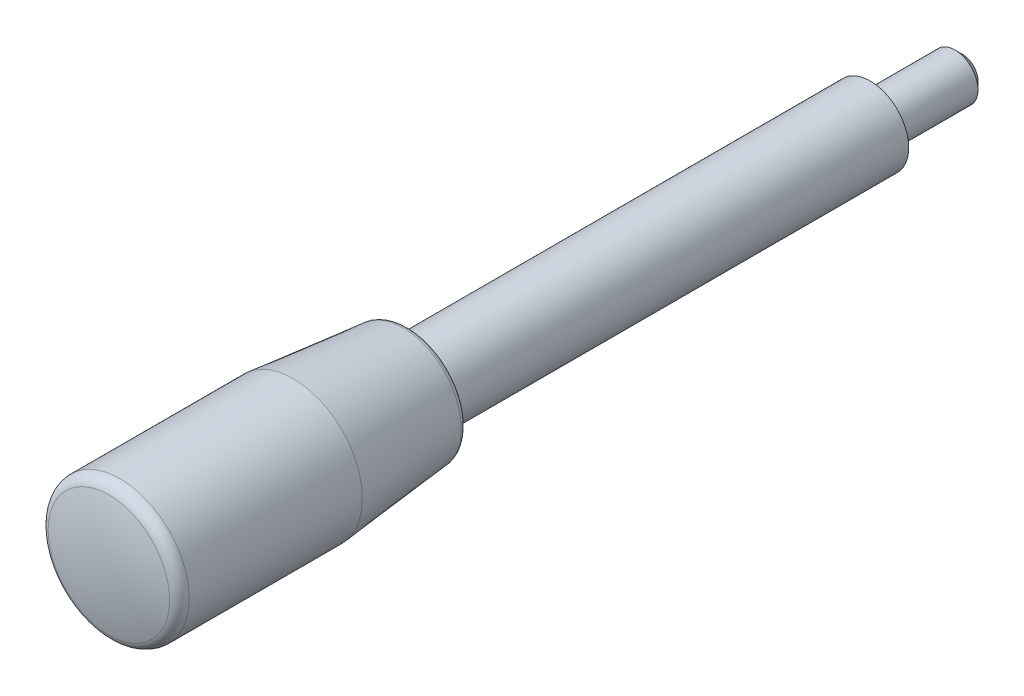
ISO-10303-21;
HEADER;
FILE_DESCRIPTION(('STEP AP214'),'2;1');
FILE_NAME('part.step','',(''),(''),'','','');
FILE_SCHEMA(('AUTOMOTIVE_DESIGN { 1 0 10303 214 1 1 1 1 }'));
ENDSEC;
DATA;
#1=APPLICATION_CONTEXT('core data for automotive mechanical design processes');
#2=APPLICATION_PROTOCOL_DEFINITION('international standard','automotive_design',2000,#1);
#3=PRODUCT_CONTEXT('',#1,'mechanical');
#4=PRODUCT('Part','Part','',(#3));
#5=PRODUCT_RELATED_PRODUCT_CATEGORY('part','',(#4));
#6=PRODUCT_DEFINITION_FORMATION('','',#4);
#7=PRODUCT_DEFINITION_CONTEXT('part definition',#1,'design');
#8=PRODUCT_DEFINITION('design','',#6,#7);
#9=PRODUCT_DEFINITION_SHAPE('','',#8);
#10=(LENGTH_UNIT() NAMED_UNIT(*) SI_UNIT(.MILLI.,.METRE.));
#11=(NAMED_UNIT(*) PLANE_ANGLE_UNIT() SI_UNIT($,.RADIAN.));
#12=(NAMED_UNIT(*) SI_UNIT($,.STERADIAN.) SOLID_ANGLE_UNIT());
#13=UNCERTAINTY_MEASURE_WITH_UNIT(LENGTH_MEASURE(1.E-05),#10,'distance_accuracy_value','');
#14=(GEOMETRIC_REPRESENTATION_CONTEXT(3) GLOBAL_UNCERTAINTY_ASSIGNED_CONTEXT((#13)) GLOBAL_UNIT_ASSIGNED_CONTEXT((#10,
#11,#12)) REPRESENTATION_CONTEXT('',''));
#15=CARTESIAN_POINT('',(0.,0.,0.));
#16=DIRECTION('',(0.,0.,1.));
#17=DIRECTION('',(1.,0.,0.));
#18=AXIS2_PLACEMENT_3D('',#15,#16,#17);
#19=CARTESIAN_POINT('',(0.,0.,-22.725600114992));
#20=DIRECTION('',(0.,0.,-1.));
#21=DIRECTION('',(-1.,0.,0.));
#22=AXIS2_PLACEMENT_3D('',#19,#20,#21);
#23=CYLINDRICAL_SURFACE('',#22,3.);
#24=CARTESIAN_POINT('',(0.,0.,-11.));
#25=DIRECTION('',(0.,0.,-1.));
#26=DIRECTION('',(-1.,0.,0.));
#27=AXIS2_PLACEMENT_3D('',#24,#25,#26);
#28=CIRCLE('',#27,3.);
#29=CARTESIAN_POINT('',(-3.,0.,-11.));
#30=VERTEX_POINT('',#29);
#31=EDGE_CURVE('E8',#30,#30,#28,.T.);
#32=ORIENTED_EDGE('',*,*,#31,.F.);
#33=EDGE_LOOP('',(#32));
#34=FACE_BOUND('',#33,.T.);
#35=CARTESIAN_POINT('',(0.,0.,0.));
#36=DIRECTION('',(0.,0.,-1.));
#37=DIRECTION('',(-1.,0.,0.));
#38=AXIS2_PLACEMENT_3D('',#35,#36,#37);
#39=CIRCLE('',#38,3.);
#40=CARTESIAN_POINT('',(-3.,0.,0.));
#41=VERTEX_POINT('',#40);
#42=EDGE_CURVE('E46',#41,#41,#39,.T.);
#43=ORIENTED_EDGE('',*,*,#42,.T.);
#44=EDGE_LOOP('',(#43));
#45=FACE_BOUND('',#44,.T.);
#46=ADVANCED_FACE('F12',(#34,#45),#23,.T.);
#47=CARTESIAN_POINT('',(0.,0.,-11.));
#48=DIRECTION('',(0.,0.,1.));
#49=DIRECTION('',(1.,0.,0.));
#50=AXIS2_PLACEMENT_3D('',#47,#48,#49);
#51=CONICAL_SURFACE('',#50,3.,0.785398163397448);
#52=CARTESIAN_POINT('',(0.,0.,-12.));
#53=DIRECTION('',(0.,0.,-1.));
#54=DIRECTION('',(-1.,0.,0.));
#55=AXIS2_PLACEMENT_3D('',#52,#53,#54);
#56=CIRCLE('',#55,1.99999999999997);
#57=CARTESIAN_POINT('',(-1.99999999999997,0.,-12.));
#58=VERTEX_POINT('',#57);
#59=EDGE_CURVE('E18',#58,#58,#56,.T.);
#60=ORIENTED_EDGE('',*,*,#59,.F.);
#61=EDGE_LOOP('',(#60));
#62=FACE_BOUND('',#61,.T.);
#63=ORIENTED_EDGE('',*,*,#31,.T.);
#64=EDGE_LOOP('',(#63));
#65=FACE_BOUND('',#64,.T.);
#66=ADVANCED_FACE('F102',(#62,#65),#51,.T.);
#67=CARTESIAN_POINT('',(0.,2.,-12.));
#68=DIRECTION('',(0.,0.,1.));
#69=DIRECTION('',(1.,0.,0.));
#70=AXIS2_PLACEMENT_3D('',#67,#68,#69);
#71=PLANE('',#70);
#72=ORIENTED_EDGE('',*,*,#59,.T.);
#73=EDGE_LOOP('',(#72));
#74=FACE_BOUND('',#73,.T.);
#75=ADVANCED_FACE('F95',(#74),#71,.F.);
#76=CARTESIAN_POINT('',(0.,0.,70.));
#77=DIRECTION('',(-1.,0.,0.));
#78=DIRECTION('',(0.,0.,1.));
#79=AXIS2_PLACEMENT_3D('',#76,#77,#78);
#80=SPHERICAL_SURFACE('',#79,30.);
#81=CARTESIAN_POINT('',(0.,0.,70.));
#82=DIRECTION('',(0.,0.,-1.));
#83=DIRECTION('',(-1.,0.,0.));
#84=AXIS2_PLACEMENT_3D('',#81,#82,#83);
#85=SPHERICAL_SURFACE('',#84,30.);
#86=CARTESIAN_POINT('',(0.,0.,98.9425833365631));
#87=DIRECTION('',(0.,0.,-1.));
#88=DIRECTION('',(-1.,0.,0.));
#89=AXIS2_PLACEMENT_3D('',#86,#87,#88);
#90=CIRCLE('',#89,7.89473684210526);
#91=CARTESIAN_POINT('',(-7.89473684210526,0.,98.9425833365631));
#92=VERTEX_POINT('',#91);
#93=EDGE_CURVE('E22',#92,#92,#90,.T.);
#94=ORIENTED_EDGE('',*,*,#93,.F.);
#95=EDGE_LOOP('',(#94));
#96=FACE_BOUND('',#95,.T.);
#97=ADVANCED_FACE('F90',(#96),#85,.T.);
#98=CARTESIAN_POINT('',(0.,0.,97.4954541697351));
#99=DIRECTION('',(0.,0.,-1.));
#100=DIRECTION('',(-1.,0.,0.));
#101=AXIS2_PLACEMENT_3D('',#98,#99,#100);
#102=TOROIDAL_SURFACE('',#101,7.5,1.5);
#103=CARTESIAN_POINT('',(0.,0.,97.4954541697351));
#104=DIRECTION('',(0.,0.,-1.));
#105=DIRECTION('',(-1.,0.,0.));
#106=AXIS2_PLACEMENT_3D('',#103,#104,#105);
#107=CIRCLE('',#106,9.);
#108=CARTESIAN_POINT('',(-9.,0.,97.4954541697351));
#109=VERTEX_POINT('',#108);
#110=EDGE_CURVE('E26',#109,#109,#107,.T.);
#111=ORIENTED_EDGE('',*,*,#110,.F.);
#112=EDGE_LOOP('',(#111));
#113=FACE_BOUND('',#112,.T.);
#114=ORIENTED_EDGE('',*,*,#93,.T.);
#115=EDGE_LOOP('',(#114));
#116=FACE_BOUND('',#115,.T.);
#117=ADVANCED_FACE('F84',(#113,#116),#102,.T.);
#118=CARTESIAN_POINT('',(0.,0.,-22.725600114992));
#119=DIRECTION('',(0.,0.,-1.));
#120=DIRECTION('',(-1.,0.,0.));
#121=AXIS2_PLACEMENT_3D('',#118,#119,#120);
#122=CYLINDRICAL_SURFACE('',#121,9.);
#123=CARTESIAN_POINT('',(0.,0.,75.));
#124=DIRECTION('',(0.,0.,-1.));
#125=DIRECTION('',(-1.,0.,0.));
#126=AXIS2_PLACEMENT_3D('',#123,#124,#125);
#127=CIRCLE('',#126,9.);
#128=CARTESIAN_POINT('',(-9.,0.,75.));
#129=VERTEX_POINT('',#128);
#130=EDGE_CURVE('E31',#129,#129,#127,.T.);
#131=ORIENTED_EDGE('',*,*,#130,.F.);
#132=EDGE_LOOP('',(#131));
#133=FACE_BOUND('',#132,.T.);
#134=ORIENTED_EDGE('',*,*,#110,.T.);
#135=EDGE_LOOP('',(#134));
#136=FACE_BOUND('',#135,.T.);
#137=ADVANCED_FACE('F78',(#133,#136),#122,.T.);
#138=CARTESIAN_POINT('',(0.,0.,75.));
#139=DIRECTION('',(0.,0.,1.));
#140=DIRECTION('',(1.,0.,0.));
#141=AXIS2_PLACEMENT_3D('',#138,#139,#140);
#142=CONICAL_SURFACE('',#141,9.,0.0996686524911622);
#143=CARTESIAN_POINT('',(0.,0.,60.7203970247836));
#144=DIRECTION('',(0.,0.,-1.));
#145=DIRECTION('',(-1.,0.,0.));
#146=AXIS2_PLACEMENT_3D('',#143,#144,#145);
#147=CIRCLE('',#146,7.57203970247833);
#148=CARTESIAN_POINT('',(-7.57203970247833,0.,60.7203970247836));
#149=VERTEX_POINT('',#148);
#150=EDGE_CURVE('E34',#149,#149,#147,.T.);
#151=ORIENTED_EDGE('',*,*,#150,.F.);
#152=EDGE_LOOP('',(#151));
#153=FACE_BOUND('',#152,.T.);
#154=ORIENTED_EDGE('',*,*,#130,.T.);
#155=EDGE_LOOP('',(#154));
#156=FACE_BOUND('',#155,.T.);
#157=ADVANCED_FACE('F72',(#153,#156),#142,.T.);
#158=CARTESIAN_POINT('',(0.,0.,60.8));
#159=DIRECTION('',(0.,0.,-1.));
#160=DIRECTION('',(-1.,0.,0.));
#161=AXIS2_PLACEMENT_3D('',#158,#159,#160);
#162=TOROIDAL_SURFACE('',#161,6.7760099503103,0.800000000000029);
#163=CARTESIAN_POINT('',(0.,0.,60.));
#164=DIRECTION('',(0.,0.,-1.));
#165=DIRECTION('',(-1.,0.,0.));
#166=AXIS2_PLACEMENT_3D('',#163,#164,#165);
#167=CIRCLE('',#166,6.7760099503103);
#168=CARTESIAN_POINT('',(-6.7760099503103,0.,60.));
#169=VERTEX_POINT('',#168);
#170=EDGE_CURVE('E37',#169,#169,#167,.T.);
#171=ORIENTED_EDGE('',*,*,#170,.F.);
#172=EDGE_LOOP('',(#171));
#173=FACE_BOUND('',#172,.T.);
#174=ORIENTED_EDGE('',*,*,#150,.T.);
#175=EDGE_LOOP('',(#174));
#176=FACE_BOUND('',#175,.T.);
#177=ADVANCED_FACE('F66',(#173,#176),#162,.T.);
#178=CARTESIAN_POINT('',(0.,6.77600995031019,60.));
#179=DIRECTION('',(0.,0.,1.));
#180=DIRECTION('',(1.,0.,0.));
#181=AXIS2_PLACEMENT_3D('',#178,#179,#180);
#182=PLANE('',#181);
#183=CARTESIAN_POINT('',(0.,0.,60.));
#184=DIRECTION('',(0.,0.,-1.));
#185=DIRECTION('',(-1.,0.,0.));
#186=AXIS2_PLACEMENT_3D('',#183,#184,#185);
#187=CIRCLE('',#186,5.);
#188=CARTESIAN_POINT('',(-5.,0.,60.));
#189=VERTEX_POINT('',#188);
#190=EDGE_CURVE('E40',#189,#189,#187,.T.);
#191=ORIENTED_EDGE('',*,*,#190,.F.);
#192=EDGE_LOOP('',(#191));
#193=FACE_BOUND('',#192,.T.);
#194=ORIENTED_EDGE('',*,*,#170,.T.);
#195=EDGE_LOOP('',(#194));
#196=FACE_BOUND('',#195,.T.);
#197=ADVANCED_FACE('F60',(#193,#196),#182,.F.);
#198=CARTESIAN_POINT('',(0.,0.,-22.725600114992));
#199=DIRECTION('',(0.,0.,-1.));
#200=DIRECTION('',(-1.,0.,0.));
#201=AXIS2_PLACEMENT_3D('',#198,#199,#200);
#202=CYLINDRICAL_SURFACE('',#201,5.);
#203=CARTESIAN_POINT('',(0.,0.,0.));
#204=DIRECTION('',(0.,0.,-1.));
#205=DIRECTION('',(-1.,0.,0.));
#206=AXIS2_PLACEMENT_3D('',#203,#204,#205);
#207=CIRCLE('',#206,5.);
#208=CARTESIAN_POINT('',(-5.,0.,0.));
#209=VERTEX_POINT('',#208);
#210=EDGE_CURVE('E43',#209,#209,#207,.T.);
#211=ORIENTED_EDGE('',*,*,#210,.F.);
#212=EDGE_LOOP('',(#211));
#213=FACE_BOUND('',#212,.T.);
#214=ORIENTED_EDGE('',*,*,#190,.T.);
#215=EDGE_LOOP('',(#214));
#216=FACE_BOUND('',#215,.T.);
#217=ADVANCED_FACE('F54',(#213,#216),#202,.T.);
#218=CARTESIAN_POINT('',(0.,5.,0.));
#219=DIRECTION('',(0.,0.,1.));
#220=DIRECTION('',(1.,0.,0.));
#221=AXIS2_PLACEMENT_3D('',#218,#219,#220);
#222=PLANE('',#221);
#223=ORIENTED_EDGE('',*,*,#42,.F.);
#224=EDGE_LOOP('',(#223));
#225=FACE_BOUND('',#224,.T.);
#226=ORIENTED_EDGE('',*,*,#210,.T.);
#227=EDGE_LOOP('',(#226));
#228=FACE_BOUND('',#227,.T.);
#229=ADVANCED_FACE('F51',(#225,#228),#222,.F.);
#230=CLOSED_SHELL('',(#46,#66,#75,#97,#117,#137,#157,#177,#197,#217,#229));
#231=MANIFOLD_SOLID_BREP('B1',#230);
#232=ADVANCED_BREP_SHAPE_REPRESENTATION('',(#18,#231),#14);
#233=SHAPE_DEFINITION_REPRESENTATION(#9,#232);
ENDSEC;
END-ISO-10303-21;
